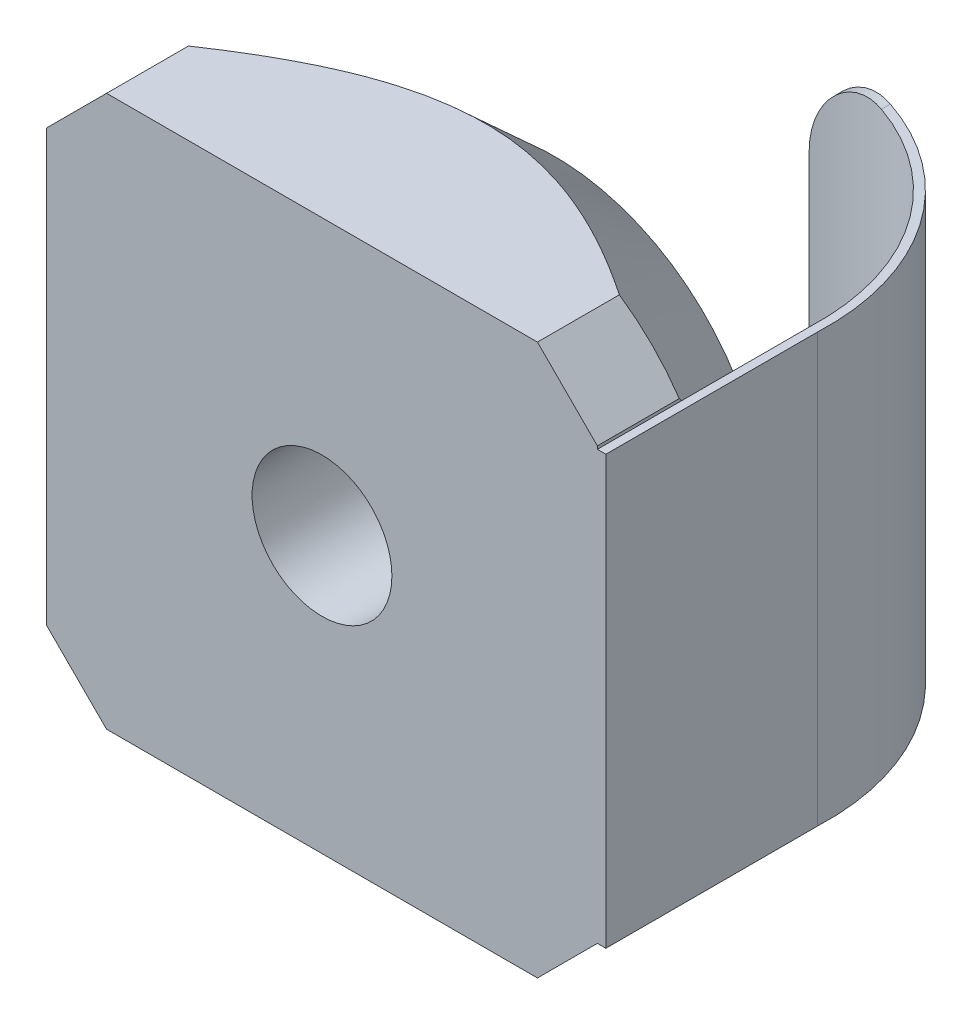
ISO-10303-21;
HEADER;
FILE_DESCRIPTION(('STEP AP214'),'2;1');
FILE_NAME('part.step','',(''),(''),'','','');
FILE_SCHEMA(('AUTOMOTIVE_DESIGN { 1 0 10303 214 1 1 1 1 }'));
ENDSEC;
DATA;
#1=APPLICATION_CONTEXT('core data for automotive mechanical design processes');
#2=APPLICATION_PROTOCOL_DEFINITION('international standard','automotive_design',2000,#1);
#3=PRODUCT_CONTEXT('',#1,'mechanical');
#4=PRODUCT('Part','Part','',(#3));
#5=PRODUCT_RELATED_PRODUCT_CATEGORY('part','',(#4));
#6=PRODUCT_DEFINITION_FORMATION('','',#4);
#7=PRODUCT_DEFINITION_CONTEXT('part definition',#1,'design');
#8=PRODUCT_DEFINITION('design','',#6,#7);
#9=PRODUCT_DEFINITION_SHAPE('','',#8);
#10=(LENGTH_UNIT() NAMED_UNIT(*) SI_UNIT(.MILLI.,.METRE.));
#11=(NAMED_UNIT(*) PLANE_ANGLE_UNIT() SI_UNIT($,.RADIAN.));
#12=(NAMED_UNIT(*) SI_UNIT($,.STERADIAN.) SOLID_ANGLE_UNIT());
#13=UNCERTAINTY_MEASURE_WITH_UNIT(LENGTH_MEASURE(1.E-05),#10,'distance_accuracy_value','');
#14=(GEOMETRIC_REPRESENTATION_CONTEXT(3) GLOBAL_UNCERTAINTY_ASSIGNED_CONTEXT((#13)) GLOBAL_UNIT_ASSIGNED_CONTEXT((#10,
#11,#12)) REPRESENTATION_CONTEXT('',''));
#15=CARTESIAN_POINT('',(0.,0.,0.));
#16=DIRECTION('',(0.,0.,1.));
#17=DIRECTION('',(1.,0.,0.));
#18=AXIS2_PLACEMENT_3D('',#15,#16,#17);
#19=CARTESIAN_POINT('',(0.,0.,-5.5));
#20=DIRECTION('',(0.,0.,1.));
#21=DIRECTION('',(1.,0.,0.));
#22=AXIS2_PLACEMENT_3D('',#19,#20,#21);
#23=PLANE('',#22);
#24=CARTESIAN_POINT('',(0.,0.,-5.5));
#25=DIRECTION('',(0.,0.,1.));
#26=DIRECTION('',(1.,0.,0.));
#27=AXIS2_PLACEMENT_3D('',#24,#25,#26);
#28=CIRCLE('',#27,1.65);
#29=CARTESIAN_POINT('',(1.65,0.,-5.5));
#30=VERTEX_POINT('',#29);
#31=EDGE_CURVE('E327',#30,#30,#28,.T.);
#32=ORIENTED_EDGE('',*,*,#31,.T.);
#33=EDGE_LOOP('',(#32));
#34=FACE_BOUND('',#33,.T.);
#35=CARTESIAN_POINT('',(0.,0.,-5.50000000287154));
#36=DIRECTION('',(0.,0.,1.));
#37=DIRECTION('',(1.,0.,0.));
#38=AXIS2_PLACEMENT_3D('',#35,#36,#37);
#39=CIRCLE('',#38,5.00000000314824);
#40=CARTESIAN_POINT('',(5.00000000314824,0.,-5.50000000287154));
#41=VERTEX_POINT('',#40);
#42=EDGE_CURVE('E288',#41,#41,#39,.T.);
#43=ORIENTED_EDGE('',*,*,#42,.F.);
#44=EDGE_LOOP('',(#43));
#45=FACE_BOUND('',#44,.T.);
#46=ADVANCED_FACE('F30',(#34,#45),#23,.F.);
#47=CARTESIAN_POINT('',(1.13061329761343,-5.08578643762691,-5.23061329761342));
#48=DIRECTION('',(0.,1.,0.));
#49=DIRECTION('',(0.,0.,1.));
#50=AXIS2_PLACEMENT_3D('',#47,#48,#49);
#51=CYLINDRICAL_SURFACE('',#50,5.37433680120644);
#52=DIRECTION('',(0.,1.,0.));
#53=VECTOR('',#52,1.);
#54=CARTESIAN_POINT('',(0.900000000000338,-5.08578643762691,-10.6));
#55=LINE('',#54,#53);
#56=CARTESIAN_POINT('',(0.900000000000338,-3.08578643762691,-10.6));
#57=VERTEX_POINT('',#56);
#58=CARTESIAN_POINT('',(0.900000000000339,3.01421356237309,-10.6));
#59=VERTEX_POINT('',#58);
#60=EDGE_CURVE('E130',#57,#59,#55,.T.);
#61=ORIENTED_EDGE('',*,*,#60,.F.);
#62=CARTESIAN_POINT('',(2.90000000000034,-5.08578643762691,-10.3053316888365));
#63=CARTESIAN_POINT('',(2.84803419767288,-5.08579244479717,-10.3234580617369));
#64=CARTESIAN_POINT('',(2.79577900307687,-5.08376089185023,-10.34077491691));
#65=CARTESIAN_POINT('',(2.69104946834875,-5.07553358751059,-10.3737183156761));
#66=CARTESIAN_POINT('',(2.63857507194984,-5.0693366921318,-10.3893443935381));
#67=CARTESIAN_POINT('',(2.53380993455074,-5.05269177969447,-10.4188209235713));
#68=CARTESIAN_POINT('',(2.48151914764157,-5.04224491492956,-10.4326718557));
#69=CARTESIAN_POINT('',(2.37754341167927,-5.01708267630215,-10.4585706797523));
#70=CARTESIAN_POINT('',(2.32585839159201,-5.00236780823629,-10.4706187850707));
#71=CARTESIAN_POINT('',(2.17211110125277,-4.95174451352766,-10.504107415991));
#72=CARTESIAN_POINT('',(2.07148948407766,-4.90937809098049,-10.5228554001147));
#73=CARTESIAN_POINT('',(1.8778476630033,-4.80832605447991,-10.5536557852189));
#74=CARTESIAN_POINT('',(1.78482256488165,-4.74965105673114,-10.5657125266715));
#75=CARTESIAN_POINT('',(1.61135189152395,-4.61905010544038,-10.5841005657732));
#76=CARTESIAN_POINT('',(1.53066546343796,-4.5474613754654,-10.5905576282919));
#77=CARTESIAN_POINT('',(1.3817294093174,-4.39209571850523,-10.5996001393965));
#78=CARTESIAN_POINT('',(1.31348514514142,-4.30831356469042,-10.602183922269));
#79=CARTESIAN_POINT('',(1.19010431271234,-4.12902241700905,-10.6049836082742));
#80=CARTESIAN_POINT('',(1.13526474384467,-4.03330843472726,-10.605149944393));
#81=CARTESIAN_POINT('',(1.04205250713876,-3.83419182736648,-10.6044227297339));
#82=CARTESIAN_POINT('',(1.00367583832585,-3.7307910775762,-10.6035294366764));
#83=CARTESIAN_POINT('',(0.949511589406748,-3.53731687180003,-10.6019565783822));
#84=CARTESIAN_POINT('',(0.930977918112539,-3.4480009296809,-10.6012666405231));
#85=CARTESIAN_POINT('',(0.906208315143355,-3.26772910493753,-10.6002660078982));
#86=CARTESIAN_POINT('',(0.899965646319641,-3.17677414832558,-10.5999551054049));
#87=CARTESIAN_POINT('',(0.900000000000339,-3.08578643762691,-10.6));
#88=B_SPLINE_CURVE_WITH_KNOTS('',3,(#62,#63,#64,#65,#66,#67,#68,#69,#70,#71,#72,#73,#74,#75,#76,
#77,#78,#79,#80,#81,#82,#83,#84,#85,#86,#87),.UNSPECIFIED.,.F.,.F.,(4,2,2,2,2,2,2,2,2,2,2,2,4),
(0.,0.165074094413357,0.330193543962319,0.495268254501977,0.660323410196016,0.990846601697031,
1.32115513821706,1.64383733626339,1.96665826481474,2.29608914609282,2.625439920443,
2.89827884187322,3.17096816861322),.UNSPECIFIED.);
#89=CARTESIAN_POINT('',(2.90000000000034,-5.08578643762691,-10.3053316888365));
#90=VERTEX_POINT('',#89);
#91=EDGE_CURVE('E136',#90,#57,#88,.T.);
#92=ORIENTED_EDGE('',*,*,#91,.F.);
#93=CARTESIAN_POINT('',(1.13061329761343,-5.08578643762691,-5.23061329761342));
#94=DIRECTION('',(0.,1.,0.));
#95=DIRECTION('',(0.,0.,1.));
#96=AXIS2_PLACEMENT_3D('',#93,#94,#95);
#97=CIRCLE('',#96,5.37433680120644);
#98=CARTESIAN_POINT('',(6.5,-5.08578643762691,-5.));
#99=VERTEX_POINT('',#98);
#100=EDGE_CURVE('E264',#90,#99,#97,.F.);
#101=ORIENTED_EDGE('',*,*,#100,.T.);
#102=DIRECTION('',(0.,1.,0.));
#103=VECTOR('',#102,1.);
#104=CARTESIAN_POINT('',(6.5,-5.08578643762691,-5.00000000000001));
#105=LINE('',#104,#103);
#106=CARTESIAN_POINT('',(6.5,5.01421356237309,-5.00000000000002));
#107=VERTEX_POINT('',#106);
#108=EDGE_CURVE('E137',#107,#99,#105,.F.);
#109=ORIENTED_EDGE('',*,*,#108,.F.);
#110=CARTESIAN_POINT('',(1.13061329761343,5.01421356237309,-5.23061329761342));
#111=DIRECTION('',(0.,1.,0.));
#112=DIRECTION('',(0.,0.,1.));
#113=AXIS2_PLACEMENT_3D('',#110,#111,#112);
#114=CIRCLE('',#113,5.37433680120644);
#115=CARTESIAN_POINT('',(2.90000000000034,5.01421356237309,-10.3053316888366));
#116=VERTEX_POINT('',#115);
#117=EDGE_CURVE('E133',#116,#107,#114,.F.);
#118=ORIENTED_EDGE('',*,*,#117,.F.);
#119=CARTESIAN_POINT('',(0.900000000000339,3.01421356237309,-10.6));
#120=CARTESIAN_POINT('',(0.900000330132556,3.07046535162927,-10.5999949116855));
#121=CARTESIAN_POINT('',(0.902374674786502,3.12669009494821,-10.6001025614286));
#122=CARTESIAN_POINT('',(0.911846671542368,3.23873632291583,-10.6004988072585));
#123=CARTESIAN_POINT('',(0.918944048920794,3.29455783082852,-10.6007873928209));
#124=CARTESIAN_POINT('',(0.947254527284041,3.46073025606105,-10.6018566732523));
#125=CARTESIAN_POINT('',(0.975486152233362,3.56996713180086,-10.6028411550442));
#126=CARTESIAN_POINT('',(1.04988306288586,3.78215272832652,-10.6044710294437));
#127=CARTESIAN_POINT('',(1.0960569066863,3.88509842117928,-10.6051162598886));
#128=CARTESIAN_POINT('',(1.20503246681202,4.08178799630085,-10.6047100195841));
#129=CARTESIAN_POINT('',(1.2678326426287,4.17553272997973,-10.6036587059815));
#130=CARTESIAN_POINT('',(1.40800107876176,4.35081056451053,-10.5982422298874));
#131=CARTESIAN_POINT('',(1.48532101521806,4.43238260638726,-10.593887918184));
#132=CARTESIAN_POINT('',(1.6522600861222,4.58126236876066,-10.58022750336));
#133=CARTESIAN_POINT('',(1.74187515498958,4.64857478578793,-10.5709230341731));
#134=CARTESIAN_POINT('',(1.92817494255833,4.76560487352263,-10.5462505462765));
#135=CARTESIAN_POINT('',(2.02464050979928,4.81570333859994,-10.5310321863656));
#136=CARTESIAN_POINT('',(2.22328367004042,4.89932935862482,-10.4936700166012));
#137=CARTESIAN_POINT('',(2.32546183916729,4.93285523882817,-10.4715255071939));
#138=CARTESIAN_POINT('',(2.50694959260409,4.97686434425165,-10.4263509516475));
#139=CARTESIAN_POINT('',(2.58579039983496,4.99096532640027,-10.4048403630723));
#140=CARTESIAN_POINT('',(2.74330698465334,5.00964641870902,-10.3579469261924));
#141=CARTESIAN_POINT('',(2.82198281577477,5.01424259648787,-10.3325706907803));
#142=CARTESIAN_POINT('',(2.90000000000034,5.01421356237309,-10.3053316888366));
#143=B_SPLINE_CURVE_WITH_KNOTS('',3,(#119,#120,#121,#122,#123,#124,#125,#126,#127,#128,#129,
#130,#131,#132,#133,#134,#135,#136,#137,#138,#139,#140,#141,#142),.UNSPECIFIED.,.F.,.F.,(4,2,2,
2,2,2,2,2,2,2,2,4),(0.,0.168651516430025,0.337293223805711,0.674049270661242,1.01096614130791,
1.3478518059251,1.68363552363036,2.01930847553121,2.34698849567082,2.67470162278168,
2.92287445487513,3.17062741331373),.UNSPECIFIED.);
#144=EDGE_CURVE('E33',#59,#116,#143,.T.);
#145=ORIENTED_EDGE('',*,*,#144,.F.);
#146=EDGE_LOOP('',(#61,#92,#101,#109,#118,#145));
#147=FACE_BOUND('',#146,.T.);
#148=ADVANCED_FACE('F128',(#147),#51,.F.);
#149=CARTESIAN_POINT('',(6.5,-5.08578643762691,0.));
#150=DIRECTION('',(-1.,0.,0.));
#151=DIRECTION('',(0.,0.,1.));
#152=AXIS2_PLACEMENT_3D('',#149,#150,#151);
#153=PLANE('',#152);
#154=ORIENTED_EDGE('',*,*,#108,.T.);
#155=DIRECTION('',(0.,0.,1.));
#156=VECTOR('',#155,1.);
#157=CARTESIAN_POINT('',(6.5,-5.08578643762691,-6.41150462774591));
#158=LINE('',#157,#156);
#159=CARTESIAN_POINT('',(6.5,-5.08578639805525,-1.93333422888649));
#160=VERTEX_POINT('',#159);
#161=EDGE_CURVE('E361',#99,#160,#158,.T.);
#162=ORIENTED_EDGE('',*,*,#161,.T.);
#163=CARTESIAN_POINT('',(6.49999999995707,5.01421356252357,-1.98147651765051));
#164=CARTESIAN_POINT('',(6.49999999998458,4.90089300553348,-2.05735219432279));
#165=CARTESIAN_POINT('',(6.49999999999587,4.78682941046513,-2.13213187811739));
#166=CARTESIAN_POINT('',(6.50000000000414,4.55705300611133,-2.27916665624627));
#167=CARTESIAN_POINT('',(6.50000000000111,4.44133984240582,-2.35142119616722));
#168=CARTESIAN_POINT('',(6.49999999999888,4.2077031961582,-2.49331131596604));
#169=CARTESIAN_POINT('',(6.49999999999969,4.08977293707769,-2.56293578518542));
#170=CARTESIAN_POINT('',(6.50000000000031,3.85200835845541,-2.69883005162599));
#171=CARTESIAN_POINT('',(6.50000000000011,3.73217414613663,-2.76510003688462));
#172=CARTESIAN_POINT('',(6.49999999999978,3.36347781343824,-2.96142749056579));
#173=CARTESIAN_POINT('',(6.49999999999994,3.11129685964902,-3.08537257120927));
#174=CARTESIAN_POINT('',(6.50000000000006,2.59770756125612,-3.31174910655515));
#175=CARTESIAN_POINT('',(6.50000000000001,2.33631394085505,-3.41421322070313));
#176=CARTESIAN_POINT('',(6.49999999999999,1.89822792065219,-3.55997176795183));
#177=CARTESIAN_POINT('',(6.5,1.72423965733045,-3.61138096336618));
#178=CARTESIAN_POINT('',(6.5,1.37277217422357,-3.70067669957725));
#179=CARTESIAN_POINT('',(6.5,1.19529289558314,-3.73856301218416));
#180=CARTESIAN_POINT('',(6.5,0.839667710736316,-3.79880141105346));
#181=CARTESIAN_POINT('',(6.5,0.661549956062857,-3.82131766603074));
#182=CARTESIAN_POINT('',(6.5,0.3040090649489,-3.8503496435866));
#183=CARTESIAN_POINT('',(6.5,0.124586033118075,-3.85686663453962));
#184=CARTESIAN_POINT('',(6.5,-0.234534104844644,-3.85354991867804));
#185=CARTESIAN_POINT('',(6.5,-0.414230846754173,-3.84367725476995));
#186=CARTESIAN_POINT('',(6.5,-0.772032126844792,-3.80803294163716));
#187=CARTESIAN_POINT('',(6.5,-0.950136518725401,-3.78225984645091));
#188=CARTESIAN_POINT('',(6.5,-1.30552029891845,-3.71570927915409));
#189=CARTESIAN_POINT('',(6.5,-1.48276890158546,-3.67476939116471));
#190=CARTESIAN_POINT('',(6.5,-1.83363232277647,-3.57968542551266));
#191=CARTESIAN_POINT('',(6.5,-2.00724719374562,-3.52554153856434));
#192=CARTESIAN_POINT('',(6.5,-2.44147704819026,-3.37423611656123));
#193=CARTESIAN_POINT('',(6.5,-2.69944314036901,-3.2694828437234));
#194=CARTESIAN_POINT('',(6.5,-3.20636233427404,-3.03963560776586));
#195=CARTESIAN_POINT('',(6.5,-3.45530232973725,-2.91451340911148));
#196=CARTESIAN_POINT('',(6.5,-3.9386424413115,-2.65236001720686));
#197=CARTESIAN_POINT('',(6.5,-4.17325100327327,-2.51570956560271));
#198=CARTESIAN_POINT('',(6.5,-4.51960285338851,-2.3026955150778));
#199=CARTESIAN_POINT('',(6.5,-4.63393607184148,-2.23048126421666));
#200=CARTESIAN_POINT('',(6.5,-4.86101206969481,-2.08364094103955));
#201=CARTESIAN_POINT('',(6.5,-4.97375516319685,-2.00901535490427));
#202=CARTESIAN_POINT('',(6.5,-5.08578635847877,-1.93333425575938));
#203=B_SPLINE_CURVE_WITH_KNOTS('',3,(#163,#164,#165,#166,#167,#168,#169,#170,#171,#172,#173,
#174,#175,#176,#177,#178,#179,#180,#181,#182,#183,#184,#185,#186,#187,#188,#189,#190,#191,#192,
#193,#194,#195,#196,#197,#198,#199,#200,#201,#202),.UNSPECIFIED.,.F.,.F.,(4,2,2,2,2,2,2,2,2,2,2,
2,2,2,2,2,2,2,2,4),(0.,0.409135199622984,0.8183596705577,1.2291540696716,1.63992541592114,
2.48215150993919,3.32308765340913,3.86690681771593,4.4107351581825,4.94865991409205,
5.48654202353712,6.02570447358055,6.56491596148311,7.11007693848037,7.6552300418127,
8.48926109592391,9.32445829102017,10.1385545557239,10.5442192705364,10.949802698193),.UNSPECIFIED.);
#204=CARTESIAN_POINT('',(6.5,5.01421356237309,-1.98147651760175));
#205=VERTEX_POINT('',#204);
#206=EDGE_CURVE('E191',#205,#160,#203,.T.);
#207=ORIENTED_EDGE('',*,*,#206,.F.);
#208=DIRECTION('',(0.,0.,1.));
#209=VECTOR('',#208,1.);
#210=CARTESIAN_POINT('',(6.5,5.01421356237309,-6.41150462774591));
#211=LINE('',#210,#209);
#212=EDGE_CURVE('E294',#107,#205,#211,.T.);
#213=ORIENTED_EDGE('',*,*,#212,.F.);
#214=EDGE_LOOP('',(#154,#162,#207,#213));
#215=FACE_BOUND('',#214,.T.);
#216=ADVANCED_FACE('F269',(#215),#153,.T.);
#217=CARTESIAN_POINT('',(2.90000000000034,3.01421356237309,-8.50575231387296));
#218=DIRECTION('',(0.,0.,-1.));
#219=DIRECTION('',(0.,1.,0.));
#220=AXIS2_PLACEMENT_3D('',#217,#218,#219);
#221=CYLINDRICAL_SURFACE('',#220,2.);
#222=ORIENTED_EDGE('',*,*,#144,.T.);
#223=DIRECTION('',(0.,0.,1.));
#224=VECTOR('',#223,1.);
#225=CARTESIAN_POINT('',(2.90000000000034,5.01421356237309,-6.41150462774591));
#226=LINE('',#225,#224);
#227=CARTESIAN_POINT('',(2.90000000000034,5.01421356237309,-10.5164927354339));
#228=VERTEX_POINT('',#227);
#229=EDGE_CURVE('E291',#228,#116,#226,.T.);
#230=ORIENTED_EDGE('',*,*,#229,.F.);
#231=CARTESIAN_POINT('',(0.900000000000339,3.01421356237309,-10.8));
#232=CARTESIAN_POINT('',(0.90000033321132,3.07046660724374,-10.7999950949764));
#233=CARTESIAN_POINT('',(0.902374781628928,3.12669261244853,-10.8000988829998));
#234=CARTESIAN_POINT('',(0.911847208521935,3.2387414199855,-10.8004809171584));
#235=CARTESIAN_POINT('',(0.918944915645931,3.29456424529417,-10.8007591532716));
#236=CARTESIAN_POINT('',(0.947256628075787,3.46073994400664,-10.8017900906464));
#237=CARTESIAN_POINT('',(0.975489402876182,3.56997882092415,-10.8027392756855));
#238=CARTESIAN_POINT('',(1.04988921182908,3.78216784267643,-10.8043106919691));
#239=CARTESIAN_POINT('',(1.09606480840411,3.88511495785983,-10.8049327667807));
#240=CARTESIAN_POINT('',(1.20504374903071,4.08180608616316,-10.8045408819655));
#241=CARTESIAN_POINT('',(1.2678454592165,4.17555100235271,-10.8035270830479));
#242=CARTESIAN_POINT('',(1.40803624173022,4.35085229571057,-10.7983038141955));
#243=CARTESIAN_POINT('',(1.48538034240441,4.43244489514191,-10.7941040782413));
#244=CARTESIAN_POINT('',(1.65239289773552,4.58137143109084,-10.7809278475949));
#245=CARTESIAN_POINT('',(1.74205772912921,4.64870954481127,-10.7719527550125));
#246=CARTESIAN_POINT('',(1.92866159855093,4.76589089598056,-10.748131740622));
#247=CARTESIAN_POINT('',(2.02539514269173,4.81608909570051,-10.7334204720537));
#248=CARTESIAN_POINT('',(2.22467295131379,4.89984546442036,-10.6972870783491));
#249=CARTESIAN_POINT('',(2.32721752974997,4.93340273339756,-10.6758645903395));
#250=CARTESIAN_POINT('',(2.50869878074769,4.97719479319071,-10.632328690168));
#251=CARTESIAN_POINT('',(2.58712849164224,4.99116285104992,-10.611726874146));
#252=CARTESIAN_POINT('',(2.74390539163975,5.00967798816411,-10.5668354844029));
#253=CARTESIAN_POINT('',(2.82225249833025,5.01424083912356,-10.5425521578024));
#254=CARTESIAN_POINT('',(2.90000000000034,5.01421356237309,-10.5164927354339));
#255=B_SPLINE_CURVE_WITH_KNOTS('',3,(#231,#232,#233,#234,#235,#236,#237,#238,#239,#240,#241,
#242,#243,#244,#245,#246,#247,#248,#249,#250,#251,#252,#253,#254),.UNSPECIFIED.,.F.,.F.,(4,2,2,
2,2,2,2,2,2,2,2,4),(0.,0.168655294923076,0.337300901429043,0.674062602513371,1.01098520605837,
1.34787471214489,1.68373904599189,2.01950481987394,2.34782208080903,2.67615709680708,
2.92240952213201,3.16824866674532),.UNSPECIFIED.);
#256=CARTESIAN_POINT('',(0.90000000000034,3.01421356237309,-10.8));
#257=VERTEX_POINT('',#256);
#258=EDGE_CURVE('E142',#257,#228,#255,.T.);
#259=ORIENTED_EDGE('',*,*,#258,.F.);
#260=DIRECTION('',(0.,0.,1.));
#261=VECTOR('',#260,1.);
#262=CARTESIAN_POINT('',(0.900000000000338,3.01421356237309,-10.6));
#263=LINE('',#262,#261);
#264=EDGE_CURVE('E139',#59,#257,#263,.F.);
#265=ORIENTED_EDGE('',*,*,#264,.F.);
#266=EDGE_LOOP('',(#222,#230,#259,#265));
#267=FACE_BOUND('',#266,.T.);
#268=ADVANCED_FACE('F140',(#267),#221,.T.);
#269=CARTESIAN_POINT('',(2.90000000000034,-3.08578643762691,-8.50575231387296));
#270=DIRECTION('',(0.,0.,-1.));
#271=DIRECTION('',(0.,1.,0.));
#272=AXIS2_PLACEMENT_3D('',#269,#270,#271);
#273=CYLINDRICAL_SURFACE('',#272,2.);
#274=ORIENTED_EDGE('',*,*,#91,.T.);
#275=DIRECTION('',(0.,0.,1.));
#276=VECTOR('',#275,1.);
#277=CARTESIAN_POINT('',(0.900000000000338,-3.08578643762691,-10.6));
#278=LINE('',#277,#276);
#279=CARTESIAN_POINT('',(0.900000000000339,-3.08578643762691,-10.8));
#280=VERTEX_POINT('',#279);
#281=EDGE_CURVE('E146',#280,#57,#278,.T.);
#282=ORIENTED_EDGE('',*,*,#281,.F.);
#283=CARTESIAN_POINT('',(2.90000000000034,-5.08578643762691,-10.5164927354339));
#284=CARTESIAN_POINT('',(2.84773330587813,-5.08579243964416,-10.5339958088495));
#285=CARTESIAN_POINT('',(2.7951967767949,-5.08373738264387,-10.5507123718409));
#286=CARTESIAN_POINT('',(2.68994638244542,-5.07542438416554,-10.5825039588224));
#287=CARTESIAN_POINT('',(2.63723247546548,-5.06916537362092,-10.5975785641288));
#288=CARTESIAN_POINT('',(2.53203314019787,-5.05236625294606,-10.6260042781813));
#289=CARTESIAN_POINT('',(2.47954764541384,-5.04182748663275,-10.6393559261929));
#290=CARTESIAN_POINT('',(2.37522367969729,-5.01645900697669,-10.6643117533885));
#291=CARTESIAN_POINT('',(2.3233851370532,-5.00162977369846,-10.6759161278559));
#292=CARTESIAN_POINT('',(2.16924708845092,-4.95064339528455,-10.7081555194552));
#293=CARTESIAN_POINT('',(2.06844710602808,-4.90800669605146,-10.7261843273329));
#294=CARTESIAN_POINT('',(1.87457099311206,-4.80639248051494,-10.7557763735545));
#295=CARTESIAN_POINT('',(1.78149015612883,-4.7474250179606,-10.7673435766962));
#296=CARTESIAN_POINT('',(1.60786619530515,-4.6161382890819,-10.7849753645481));
#297=CARTESIAN_POINT('',(1.52709626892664,-4.54413384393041,-10.791153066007));
#298=CARTESIAN_POINT('',(1.37811156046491,-4.38790607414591,-10.7997766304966));
#299=CARTESIAN_POINT('',(1.30990199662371,-4.30367769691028,-10.8022209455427));
#300=CARTESIAN_POINT('',(1.18678163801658,-4.12357808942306,-10.8048373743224));
#301=CARTESIAN_POINT('',(1.13215296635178,-4.02751350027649,-10.8049647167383));
#302=CARTESIAN_POINT('',(1.03944887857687,-3.82772407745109,-10.8042200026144));
#303=CARTESIAN_POINT('',(1.00136905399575,-3.72400129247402,-10.8033482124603));
#304=CARTESIAN_POINT('',(0.948189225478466,-3.53131953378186,-10.8018401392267));
#305=CARTESIAN_POINT('',(0.930148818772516,-3.4431591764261,-10.8011900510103));
#306=CARTESIAN_POINT('',(0.906041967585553,-3.26527166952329,-10.8002496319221));
#307=CARTESIAN_POINT('',(0.899968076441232,-3.1755455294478,-10.7999590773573));
#308=CARTESIAN_POINT('',(0.900000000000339,-3.08578643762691,-10.8));
#309=B_SPLINE_CURVE_WITH_KNOTS('',3,(#283,#284,#285,#286,#287,#288,#289,#290,#291,#292,#293,
#294,#295,#296,#297,#298,#299,#300,#301,#302,#303,#304,#305,#306,#307,#308),.UNSPECIFIED.,.F.,
.F.,(4,2,2,2,2,2,2,2,2,2,2,2,4),(0.,0.165322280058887,0.330686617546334,0.495999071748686,
0.661293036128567,0.992258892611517,1.32302144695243,1.64666220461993,1.97043711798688,
2.30046189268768,2.63039869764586,2.89957755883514,3.1685888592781),.UNSPECIFIED.);
#310=CARTESIAN_POINT('',(2.90000000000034,-5.08578643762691,-10.5164927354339));
#311=VERTEX_POINT('',#310);
#312=EDGE_CURVE('E237',#311,#280,#309,.T.);
#313=ORIENTED_EDGE('',*,*,#312,.F.);
#314=DIRECTION('',(0.,0.,1.));
#315=VECTOR('',#314,1.);
#316=CARTESIAN_POINT('',(2.90000000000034,-5.08578643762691,-6.41150462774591));
#317=LINE('',#316,#315);
#318=EDGE_CURVE('E263',#311,#90,#317,.T.);
#319=ORIENTED_EDGE('',*,*,#318,.T.);
#320=EDGE_LOOP('',(#274,#282,#313,#319));
#321=FACE_BOUND('',#320,.T.);
#322=ADVANCED_FACE('F268',(#321),#273,.T.);
#323=CARTESIAN_POINT('',(0.900000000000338,-5.08578643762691,-10.6));
#324=DIRECTION('',(-1.,0.,0.));
#325=DIRECTION('',(0.,0.,1.));
#326=AXIS2_PLACEMENT_3D('',#323,#324,#325);
#327=PLANE('',#326);
#328=ORIENTED_EDGE('',*,*,#281,.T.);
#329=ORIENTED_EDGE('',*,*,#60,.T.);
#330=ORIENTED_EDGE('',*,*,#264,.T.);
#331=DIRECTION('',(0.,1.,0.));
#332=VECTOR('',#331,1.);
#333=CARTESIAN_POINT('',(0.90000000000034,-5.08578643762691,-10.8));
#334=LINE('',#333,#332);
#335=EDGE_CURVE('E236',#280,#257,#334,.T.);
#336=ORIENTED_EDGE('',*,*,#335,.F.);
#337=EDGE_LOOP('',(#328,#329,#330,#336));
#338=FACE_BOUND('',#337,.T.);
#339=ADVANCED_FACE('F148',(#338),#327,.T.);
#340=CARTESIAN_POINT('',(6.5,-5.08578643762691,0.));
#341=DIRECTION('',(1.,0.,0.));
#342=DIRECTION('',(0.,0.,-1.));
#343=AXIS2_PLACEMENT_3D('',#340,#341,#342);
#344=PLANE('',#343);
#345=DIRECTION('',(0.,0.,1.));
#346=VECTOR('',#345,1.);
#347=CARTESIAN_POINT('',(6.5,5.08578643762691,0.));
#348=LINE('',#347,#346);
#349=CARTESIAN_POINT('',(6.5,5.08578643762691,0.));
#350=VERTEX_POINT('',#349);
#351=CARTESIAN_POINT('',(6.50000000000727,5.08578643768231,-1.93333420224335));
#352=VERTEX_POINT('',#351);
#353=EDGE_CURVE('E235',#350,#352,#348,.F.);
#354=ORIENTED_EDGE('',*,*,#353,.F.);
#355=DIRECTION('',(0.,1.,0.));
#356=VECTOR('',#355,1.);
#357=CARTESIAN_POINT('',(6.5,-5.08578643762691,0.));
#358=LINE('',#357,#356);
#359=CARTESIAN_POINT('',(6.5,5.01421356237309,0.));
#360=VERTEX_POINT('',#359);
#361=EDGE_CURVE('E149',#350,#360,#358,.F.);
#362=ORIENTED_EDGE('',*,*,#361,.T.);
#363=DIRECTION('',(0.,0.,1.));
#364=VECTOR('',#363,1.);
#365=CARTESIAN_POINT('',(6.5,5.01421356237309,-6.41150462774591));
#366=LINE('',#365,#364);
#367=EDGE_CURVE('E156',#205,#360,#366,.T.);
#368=ORIENTED_EDGE('',*,*,#367,.F.);
#369=CARTESIAN_POINT('',(6.49999999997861,5.08578643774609,-1.93333420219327));
#370=CARTESIAN_POINT('',(6.4999999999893,5.07387404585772,-1.94138233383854));
#371=CARTESIAN_POINT('',(6.49999999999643,5.0619534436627,-1.94941825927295));
#372=CARTESIAN_POINT('',(6.50000000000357,5.03809581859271,-1.96546569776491));
#373=CARTESIAN_POINT('',(6.50000000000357,5.02615879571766,-1.9734772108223));
#374=CARTESIAN_POINT('',(6.5,5.01421356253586,-1.98147651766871));
#375=B_SPLINE_CURVE_WITH_KNOTS('',3,(#369,#370,#371,#372,#373,#374),.UNSPECIFIED.,.F.,.F.,(4,2,
4),(0.,0.0431287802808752,0.0862575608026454),.UNSPECIFIED.);
#376=EDGE_CURVE('E151',#352,#205,#375,.T.);
#377=ORIENTED_EDGE('',*,*,#376,.F.);
#378=EDGE_LOOP('',(#354,#362,#368,#377));
#379=FACE_BOUND('',#378,.T.);
#380=ADVANCED_FACE('F183',(#379),#344,.T.);
#381=CARTESIAN_POINT('',(0.,0.,-1.91193420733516));
#382=DIRECTION('',(0.,0.,1.));
#383=DIRECTION('',(1.,0.,0.));
#384=AXIS2_PLACEMENT_3D('',#381,#382,#383);
#385=CONICAL_SURFACE('',#384,8.27271392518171,0.739466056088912);
#386=ORIENTED_EDGE('',*,*,#42,.T.);
#387=EDGE_LOOP('',(#386));
#388=FACE_BOUND('',#387,.T.);
#389=CARTESIAN_POINT('',(-6.49999999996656,5.08578643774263,-1.93333420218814));
#390=CARTESIAN_POINT('',(-6.49999999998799,4.97217656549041,-2.01007902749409));
#391=CARTESIAN_POINT('',(-6.49999999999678,4.85782950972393,-2.08574579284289));
#392=CARTESIAN_POINT('',(-6.50000000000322,4.62749756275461,-2.23459577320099));
#393=CARTESIAN_POINT('',(-6.50000000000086,4.51151233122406,-2.30777846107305));
#394=CARTESIAN_POINT('',(-6.49999999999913,4.27735001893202,-2.45156937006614));
#395=CARTESIAN_POINT('',(-6.49999999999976,4.15916634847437,-2.52216690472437));
#396=CARTESIAN_POINT('',(-6.50000000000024,3.92090179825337,-2.66006146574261));
#397=CARTESIAN_POINT('',(-6.50000000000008,3.80082102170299,-2.72735867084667));
#398=CARTESIAN_POINT('',(-6.49999999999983,3.43117049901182,-2.927024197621));
#399=CARTESIAN_POINT('',(-6.49999999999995,3.17828163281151,-3.05336340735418));
#400=CARTESIAN_POINT('',(-6.50000000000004,2.66320472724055,-3.2847897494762));
#401=CARTESIAN_POINT('',(-6.50000000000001,2.40103115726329,-3.38990837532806));
#402=CARTESIAN_POINT('',(-6.49999999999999,1.96194937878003,-3.54007016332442));
#403=CARTESIAN_POINT('',(-6.5,1.78780916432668,-3.5931930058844));
#404=CARTESIAN_POINT('',(-6.5,1.43593803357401,-3.68604206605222));
#405=CARTESIAN_POINT('',(-6.5,1.25820705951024,-3.72576806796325));
#406=CARTESIAN_POINT('',(-6.5,0.901971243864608,-3.78972854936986));
#407=CARTESIAN_POINT('',(-6.5,0.723496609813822,-3.81412921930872));
#408=CARTESIAN_POINT('',(-6.5,0.365074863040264,-3.84691624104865));
#409=CARTESIAN_POINT('',(-6.5,0.185127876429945,-3.85530395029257));
#410=CARTESIAN_POINT('',(-6.5,-0.175331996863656,-3.85561829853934));
#411=CARTESIAN_POINT('',(-6.5,-0.355844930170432,-3.84749448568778));
#412=CARTESIAN_POINT('',(-6.5,-0.715412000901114,-3.81512247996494));
#413=CARTESIAN_POINT('',(-6.5,-0.894466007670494,-3.79087285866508));
#414=CARTESIAN_POINT('',(-6.5,-1.25186987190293,-3.72710369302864));
#415=CARTESIAN_POINT('',(-6.5,-1.43018938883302,-3.6874161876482));
#416=CARTESIAN_POINT('',(-6.5,-1.7832209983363,-3.59454247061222));
#417=CARTESIAN_POINT('',(-6.5,-1.95793314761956,-3.54135647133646));
#418=CARTESIAN_POINT('',(-6.5,-2.39791270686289,-3.39110767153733));
#419=CARTESIAN_POINT('',(-6.5,-2.66041462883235,-3.2859613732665));
#420=CARTESIAN_POINT('',(-6.5,-3.17612601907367,-3.05441341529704));
#421=CARTESIAN_POINT('',(-6.5,-3.4293209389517,-2.92798006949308));
#422=CARTESIAN_POINT('',(-6.5,-3.79940591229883,-2.72814379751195));
#423=CARTESIAN_POINT('',(-6.5,-3.91962359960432,-2.66078705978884));
#424=CARTESIAN_POINT('',(-6.5,-4.15815744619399,-2.52276484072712));
#425=CARTESIAN_POINT('',(-6.5,-4.27647350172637,-2.45209917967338));
#426=CARTESIAN_POINT('',(-6.5,-4.510894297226,-2.30816632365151));
#427=CARTESIAN_POINT('',(-6.5,-4.62700566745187,-2.23490988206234));
#428=CARTESIAN_POINT('',(-6.5,-4.85758619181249,-2.08590677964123));
#429=CARTESIAN_POINT('',(-6.5,-4.97205568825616,-2.01016064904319));
#430=CARTESIAN_POINT('',(-6.5,-5.08578643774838,-1.93333420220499));
#431=B_SPLINE_CURVE_WITH_KNOTS('',3,(#389,#390,#391,#392,#393,#394,#395,#396,#397,#398,#399,
#400,#401,#402,#403,#404,#405,#406,#407,#408,#409,#410,#411,#412,#413,#414,#415,#416,#417,#418,
#419,#420,#421,#422,#423,#424,#425,#426,#427,#428,#429,#430),.UNSPECIFIED.,.F.,.F.,(4,2,2,2,2,2,
2,2,2,2,2,2,2,2,2,2,2,2,2,2,4),(0.,0.41131042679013,0.822707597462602,1.23564791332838,
1.64856583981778,2.49590493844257,3.34197710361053,3.88772071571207,4.43347311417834,
4.97320018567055,5.51288150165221,6.05421432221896,6.59559510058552,7.1430386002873,
7.69047348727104,8.53748456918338,9.38576777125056,9.79913116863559,10.2125170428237,
10.6243522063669,11.0361002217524),.UNSPECIFIED.);
#432=CARTESIAN_POINT('',(-6.50000000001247,5.08578643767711,-1.93333420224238));
#433=VERTEX_POINT('',#432);
#434=CARTESIAN_POINT('',(-6.50000000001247,-5.08578643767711,-1.93333420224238));
#435=VERTEX_POINT('',#434);
#436=EDGE_CURVE('E209',#433,#435,#431,.T.);
#437=ORIENTED_EDGE('',*,*,#436,.F.);
#438=CARTESIAN_POINT('',(-5.08578643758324,6.50000000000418,-1.93333420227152));
#439=CARTESIAN_POINT('',(-5.20320338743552,6.38258305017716,-1.95544496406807));
#440=CARTESIAN_POINT('',(-5.32114245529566,6.26464398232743,-1.97213629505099));
#441=CARTESIAN_POINT('',(-5.55702028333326,6.02876615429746,-1.99438943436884));
#442=CARTESIAN_POINT('',(-5.6749567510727,5.9108296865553,-2.00000000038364));
#443=CARTESIAN_POINT('',(-5.91082968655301,5.67495675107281,-2.00000000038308));
#444=CARTESIAN_POINT('',(-6.02876615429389,5.55702028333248,-1.99438943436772));
#445=CARTESIAN_POINT('',(-6.2646439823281,5.32114245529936,-1.97213629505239));
#446=CARTESIAN_POINT('',(-6.38258305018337,5.20320338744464,-1.95544496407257));
#447=CARTESIAN_POINT('',(-6.50000000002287,5.08578643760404,-1.93333420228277));
#448=B_SPLINE_CURVE_WITH_KNOTS('',3,(#438,#439,#440,#441,#442,#443,#444,#445,#446,#447),
.UNSPECIFIED.,.F.,.F.,(4,2,2,2,4),(0.,0.502492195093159,1.00276834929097,1.50304450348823,
2.00553669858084),.UNSPECIFIED.);
#449=CARTESIAN_POINT('',(-5.08578643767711,6.50000000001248,-1.93333420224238));
#450=VERTEX_POINT('',#449);
#451=EDGE_CURVE('E216',#450,#433,#448,.T.);
#452=ORIENTED_EDGE('',*,*,#451,.F.);
#453=CARTESIAN_POINT('',(5.08578643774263,6.49999999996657,-1.93333420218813));
#454=CARTESIAN_POINT('',(4.9721765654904,6.49999999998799,-2.01007902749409));
#455=CARTESIAN_POINT('',(4.85782950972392,6.49999999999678,-2.08574579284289));
#456=CARTESIAN_POINT('',(4.62749756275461,6.50000000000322,-2.23459577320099));
#457=CARTESIAN_POINT('',(4.51151233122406,6.50000000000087,-2.30777846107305));
#458=CARTESIAN_POINT('',(4.27735001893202,6.49999999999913,-2.45156937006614));
#459=CARTESIAN_POINT('',(4.15916634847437,6.49999999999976,-2.52216690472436));
#460=CARTESIAN_POINT('',(3.92090179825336,6.50000000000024,-2.66006146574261));
#461=CARTESIAN_POINT('',(3.80082102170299,6.50000000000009,-2.72735867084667));
#462=CARTESIAN_POINT('',(3.43117049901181,6.49999999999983,-2.927024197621));
#463=CARTESIAN_POINT('',(3.17828163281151,6.49999999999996,-3.05336340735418));
#464=CARTESIAN_POINT('',(2.66320472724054,6.50000000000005,-3.2847897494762));
#465=CARTESIAN_POINT('',(2.40103115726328,6.50000000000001,-3.38990837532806));
#466=CARTESIAN_POINT('',(1.96194937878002,6.5,-3.54007016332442));
#467=CARTESIAN_POINT('',(1.78780916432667,6.5,-3.5931930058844));
#468=CARTESIAN_POINT('',(1.435938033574,6.50000000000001,-3.68604206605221));
#469=CARTESIAN_POINT('',(1.25820705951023,6.5,-3.72576806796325));
#470=CARTESIAN_POINT('',(0.901971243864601,6.5,-3.78972854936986));
#471=CARTESIAN_POINT('',(0.723496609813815,6.5,-3.81412921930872));
#472=CARTESIAN_POINT('',(0.365074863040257,6.5,-3.84691624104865));
#473=CARTESIAN_POINT('',(0.185127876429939,6.5,-3.85530395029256));
#474=CARTESIAN_POINT('',(-0.175331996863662,6.5,-3.85561829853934));
#475=CARTESIAN_POINT('',(-0.355844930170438,6.5,-3.84749448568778));
#476=CARTESIAN_POINT('',(-0.715412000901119,6.5,-3.81512247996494));
#477=CARTESIAN_POINT('',(-0.8944660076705,6.5,-3.79087285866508));
#478=CARTESIAN_POINT('',(-1.25186987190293,6.5,-3.72710369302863));
#479=CARTESIAN_POINT('',(-1.43018938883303,6.5,-3.68741618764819));
#480=CARTESIAN_POINT('',(-1.7832209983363,6.5,-3.59454247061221));
#481=CARTESIAN_POINT('',(-1.95793314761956,6.5,-3.54135647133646));
#482=CARTESIAN_POINT('',(-2.3979127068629,6.5,-3.39110767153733));
#483=CARTESIAN_POINT('',(-2.66041462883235,6.5,-3.2859613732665));
#484=CARTESIAN_POINT('',(-3.17612601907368,6.5,-3.05441341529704));
#485=CARTESIAN_POINT('',(-3.4293209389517,6.5,-2.92798006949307));
#486=CARTESIAN_POINT('',(-3.79940591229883,6.5,-2.72814379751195));
#487=CARTESIAN_POINT('',(-3.91962359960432,6.5,-2.66078705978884));
#488=CARTESIAN_POINT('',(-4.15815744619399,6.5,-2.52276484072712));
#489=CARTESIAN_POINT('',(-4.27647350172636,6.5,-2.45209917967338));
#490=CARTESIAN_POINT('',(-4.510894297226,6.5,-2.30816632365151));
#491=CARTESIAN_POINT('',(-4.62700566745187,6.5,-2.23490988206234));
#492=CARTESIAN_POINT('',(-4.85758619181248,6.5,-2.08590677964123));
#493=CARTESIAN_POINT('',(-4.97205568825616,6.5,-2.01016064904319));
#494=CARTESIAN_POINT('',(-5.08578643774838,6.5,-1.93333420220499));
#495=B_SPLINE_CURVE_WITH_KNOTS('',3,(#453,#454,#455,#456,#457,#458,#459,#460,#461,#462,#463,
#464,#465,#466,#467,#468,#469,#470,#471,#472,#473,#474,#475,#476,#477,#478,#479,#480,#481,#482,
#483,#484,#485,#486,#487,#488,#489,#490,#491,#492,#493,#494),.UNSPECIFIED.,.F.,.F.,(4,2,2,2,2,2,
2,2,2,2,2,2,2,2,2,2,2,2,2,2,4),(0.,0.411310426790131,0.822707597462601,1.23564791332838,
1.64856583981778,2.49590493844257,3.34197710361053,3.88772071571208,4.43347311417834,
4.97320018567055,5.51288150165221,6.05421432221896,6.59559510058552,7.1430386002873,
7.69047348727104,8.53748456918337,9.38576777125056,9.79913116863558,10.2125170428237,
10.6243522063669,11.0361002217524),.UNSPECIFIED.);
#496=CARTESIAN_POINT('',(5.08578643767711,6.50000000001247,-1.93333420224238));
#497=VERTEX_POINT('',#496);
#498=EDGE_CURVE('E222',#497,#450,#495,.T.);
#499=ORIENTED_EDGE('',*,*,#498,.F.);
#500=CARTESIAN_POINT('',(6.50000000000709,5.08578643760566,-1.93333420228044));
#501=CARTESIAN_POINT('',(6.38258305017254,5.20320338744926,-1.95544496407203));
#502=CARTESIAN_POINT('',(6.26464398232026,5.32114245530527,-1.97213629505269));
#503=CARTESIAN_POINT('',(6.02876615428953,5.55702028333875,-1.99438943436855));
#504=CARTESIAN_POINT('',(5.91082968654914,5.67495675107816,-2.0000000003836));
#505=CARTESIAN_POINT('',(5.67495675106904,5.91082968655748,-2.00000000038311));
#506=CARTESIAN_POINT('',(5.55702028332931,6.0287661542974,-1.99438943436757));
#507=CARTESIAN_POINT('',(5.32114245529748,6.26464398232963,-1.97213629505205));
#508=CARTESIAN_POINT('',(5.20320338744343,6.38258305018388,-1.95544496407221));
#509=CARTESIAN_POINT('',(5.08578643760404,6.50000000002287,-1.93333420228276));
#510=B_SPLINE_CURVE_WITH_KNOTS('',3,(#500,#501,#502,#503,#504,#505,#506,#507,#508,#509),
.UNSPECIFIED.,.F.,.F.,(4,2,2,2,4),(0.,0.502492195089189,1.00276834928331,1.50304450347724,
2.00553669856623),.UNSPECIFIED.);
#511=EDGE_CURVE('E228',#352,#497,#510,.T.);
#512=ORIENTED_EDGE('',*,*,#511,.F.);
#513=ORIENTED_EDGE('',*,*,#376,.T.);
#514=ORIENTED_EDGE('',*,*,#206,.T.);
#515=CARTESIAN_POINT('',(5.08578643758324,-6.50000000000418,-1.93333420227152));
#516=CARTESIAN_POINT('',(5.2032033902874,-6.38258304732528,-1.95544496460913));
#517=CARTESIAN_POINT('',(5.32114246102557,-6.26464397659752,-1.97213629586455));
#518=CARTESIAN_POINT('',(5.55702029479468,-6.02876614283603,-1.99438943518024));
#519=CARTESIAN_POINT('',(5.67495676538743,-5.91082967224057,-2.00000000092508));
#520=CARTESIAN_POINT('',(5.91082970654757,-5.67495673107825,-1.99999999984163));
#521=CARTESIAN_POINT('',(6.02876617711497,-5.5570202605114,-1.99438943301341));
#522=CARTESIAN_POINT('',(6.26464401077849,-5.32114242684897,-1.97213629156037));
#523=CARTESIAN_POINT('',(6.38258308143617,-5.20320335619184,-1.95544495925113));
#524=CARTESIAN_POINT('',(6.50000003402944,-5.08578640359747,-1.93333419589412));
#525=B_SPLINE_CURVE_WITH_KNOTS('',3,(#515,#516,#517,#518,#519,#520,#521,#522,#523,#524),
.UNSPECIFIED.,.F.,.F.,(4,2,2,2,4),(0.,0.502492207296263,1.0027683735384,1.50304453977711,
2.00553674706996),.UNSPECIFIED.);
#526=CARTESIAN_POINT('',(5.08578643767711,-6.50000000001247,-1.93333420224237));
#527=VERTEX_POINT('',#526);
#528=EDGE_CURVE('E158',#527,#160,#525,.T.);
#529=ORIENTED_EDGE('',*,*,#528,.F.);
#530=CARTESIAN_POINT('',(-5.08578643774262,-6.49999999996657,-1.93333420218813));
#531=CARTESIAN_POINT('',(-4.9721765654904,-6.49999999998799,-2.01007902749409));
#532=CARTESIAN_POINT('',(-4.85782950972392,-6.49999999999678,-2.08574579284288));
#533=CARTESIAN_POINT('',(-4.62749756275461,-6.50000000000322,-2.23459577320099));
#534=CARTESIAN_POINT('',(-4.51151233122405,-6.50000000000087,-2.30777846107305));
#535=CARTESIAN_POINT('',(-4.27735001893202,-6.49999999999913,-2.45156937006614));
#536=CARTESIAN_POINT('',(-4.15916634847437,-6.49999999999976,-2.52216690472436));
#537=CARTESIAN_POINT('',(-3.92090179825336,-6.50000000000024,-2.6600614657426));
#538=CARTESIAN_POINT('',(-3.80082102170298,-6.50000000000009,-2.72735867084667));
#539=CARTESIAN_POINT('',(-3.43117049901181,-6.49999999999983,-2.927024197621));
#540=CARTESIAN_POINT('',(-3.1782816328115,-6.49999999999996,-3.05336340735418));
#541=CARTESIAN_POINT('',(-2.66320472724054,-6.50000000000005,-3.2847897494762));
#542=CARTESIAN_POINT('',(-2.40103115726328,-6.50000000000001,-3.38990837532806));
#543=CARTESIAN_POINT('',(-1.96194937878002,-6.5,-3.54007016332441));
#544=CARTESIAN_POINT('',(-1.78780916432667,-6.5,-3.5931930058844));
#545=CARTESIAN_POINT('',(-1.435938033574,-6.5,-3.68604206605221));
#546=CARTESIAN_POINT('',(-1.25820705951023,-6.5,-3.72576806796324));
#547=CARTESIAN_POINT('',(-0.9019712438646,-6.5,-3.78972854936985));
#548=CARTESIAN_POINT('',(-0.723496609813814,-6.5,-3.81412921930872));
#549=CARTESIAN_POINT('',(-0.365074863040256,-6.5,-3.84691624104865));
#550=CARTESIAN_POINT('',(-0.185127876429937,-6.5,-3.85530395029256));
#551=CARTESIAN_POINT('',(0.175331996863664,-6.5,-3.85561829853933));
#552=CARTESIAN_POINT('',(0.35584493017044,-6.5,-3.84749448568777));
#553=CARTESIAN_POINT('',(0.715412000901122,-6.5,-3.81512247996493));
#554=CARTESIAN_POINT('',(0.894466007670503,-6.5,-3.79087285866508));
#555=CARTESIAN_POINT('',(1.25186987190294,-6.5,-3.72710369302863));
#556=CARTESIAN_POINT('',(1.43018938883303,-6.5,-3.68741618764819));
#557=CARTESIAN_POINT('',(1.7832209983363,-6.5,-3.59454247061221));
#558=CARTESIAN_POINT('',(1.95793314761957,-6.5,-3.54135647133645));
#559=CARTESIAN_POINT('',(2.3979127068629,-6.5,-3.39110767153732));
#560=CARTESIAN_POINT('',(2.66041462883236,-6.5,-3.28596137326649));
#561=CARTESIAN_POINT('',(3.17612601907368,-6.5,-3.05441341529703));
#562=CARTESIAN_POINT('',(3.42932093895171,-6.5,-2.92798006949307));
#563=CARTESIAN_POINT('',(3.79940591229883,-6.5,-2.72814379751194));
#564=CARTESIAN_POINT('',(3.91962359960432,-6.5,-2.66078705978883));
#565=CARTESIAN_POINT('',(4.15815744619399,-6.5,-2.52276484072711));
#566=CARTESIAN_POINT('',(4.27647350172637,-6.5,-2.45209917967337));
#567=CARTESIAN_POINT('',(4.510894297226,-6.5,-2.30816632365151));
#568=CARTESIAN_POINT('',(4.62700566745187,-6.5,-2.23490988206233));
#569=CARTESIAN_POINT('',(4.85758619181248,-6.5,-2.08590677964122));
#570=CARTESIAN_POINT('',(4.97205568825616,-6.5,-2.01016064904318));
#571=CARTESIAN_POINT('',(5.08578643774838,-6.5,-1.93333420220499));
#572=B_SPLINE_CURVE_WITH_KNOTS('',3,(#530,#531,#532,#533,#534,#535,#536,#537,#538,#539,#540,
#541,#542,#543,#544,#545,#546,#547,#548,#549,#550,#551,#552,#553,#554,#555,#556,#557,#558,#559,
#560,#561,#562,#563,#564,#565,#566,#567,#568,#569,#570,#571),.UNSPECIFIED.,.F.,.F.,(4,2,2,2,2,2,
2,2,2,2,2,2,2,2,2,2,2,2,2,2,4),(0.,0.411310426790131,0.822707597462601,1.23564791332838,
1.64856583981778,2.49590493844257,3.34197710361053,3.88772071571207,4.43347311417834,
4.97320018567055,5.51288150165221,6.05421432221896,6.59559510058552,7.1430386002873,
7.69047348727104,8.53748456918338,9.38576777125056,9.79913116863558,10.2125170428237,
10.6243522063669,11.0361002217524),.UNSPECIFIED.);
#573=CARTESIAN_POINT('',(-5.08578643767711,-6.50000000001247,-1.93333420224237));
#574=VERTEX_POINT('',#573);
#575=EDGE_CURVE('E168',#574,#527,#572,.T.);
#576=ORIENTED_EDGE('',*,*,#575,.F.);
#577=CARTESIAN_POINT('',(-6.50000000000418,-5.08578643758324,-1.93333420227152));
#578=CARTESIAN_POINT('',(-6.38258305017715,-5.20320338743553,-1.95544496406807));
#579=CARTESIAN_POINT('',(-6.26464398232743,-5.32114245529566,-1.97213629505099));
#580=CARTESIAN_POINT('',(-6.02876615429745,-5.55702028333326,-1.99438943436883));
#581=CARTESIAN_POINT('',(-5.9108296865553,-5.6749567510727,-2.00000000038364));
#582=CARTESIAN_POINT('',(-5.6749567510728,-5.91082968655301,-2.00000000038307));
#583=CARTESIAN_POINT('',(-5.55702028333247,-6.02876615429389,-1.99438943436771));
#584=CARTESIAN_POINT('',(-5.32114245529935,-6.2646439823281,-1.97213629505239));
#585=CARTESIAN_POINT('',(-5.20320338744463,-6.38258305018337,-1.95544496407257));
#586=CARTESIAN_POINT('',(-5.08578643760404,-6.50000000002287,-1.93333420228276));
#587=B_SPLINE_CURVE_WITH_KNOTS('',3,(#577,#578,#579,#580,#581,#582,#583,#584,#585,#586),
.UNSPECIFIED.,.F.,.F.,(4,2,2,2,4),(0.,0.50249219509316,1.00276834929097,1.50304450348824,
2.00553669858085),.UNSPECIFIED.);
#588=EDGE_CURVE('E202',#435,#574,#587,.T.);
#589=ORIENTED_EDGE('',*,*,#588,.F.);
#590=EDGE_LOOP('',(#437,#452,#499,#512,#513,#514,#529,#576,#589));
#591=FACE_BOUND('',#590,.T.);
#592=ADVANCED_FACE('F177',(#388,#591),#385,.T.);
#593=CARTESIAN_POINT('',(5.22168348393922,5.01421356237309,-6.41150462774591));
#594=DIRECTION('',(0.,1.,0.));
#595=DIRECTION('',(0.,0.,1.));
#596=AXIS2_PLACEMENT_3D('',#593,#594,#595);
#597=PLANE('',#596);
#598=DIRECTION('',(0.,0.,-1.));
#599=VECTOR('',#598,1.);
#600=CARTESIAN_POINT('',(6.7,5.01421356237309,-5.));
#601=LINE('',#600,#599);
#602=CARTESIAN_POINT('',(6.7,5.01421356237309,-4.99999999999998));
#603=VERTEX_POINT('',#602);
#604=CARTESIAN_POINT('',(6.7,5.01421356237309,0.));
#605=VERTEX_POINT('',#604);
#606=EDGE_CURVE('E301',#603,#605,#601,.F.);
#607=ORIENTED_EDGE('',*,*,#606,.F.);
#608=CARTESIAN_POINT('',(1.13061329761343,5.01421356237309,-5.23061329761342));
#609=DIRECTION('',(0.,1.,0.));
#610=DIRECTION('',(0.,0.,1.));
#611=AXIS2_PLACEMENT_3D('',#608,#609,#610);
#612=CIRCLE('',#611,5.57415919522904);
#613=EDGE_CURVE('E262',#228,#603,#612,.F.);
#614=ORIENTED_EDGE('',*,*,#613,.F.);
#615=ORIENTED_EDGE('',*,*,#229,.T.);
#616=ORIENTED_EDGE('',*,*,#117,.T.);
#617=ORIENTED_EDGE('',*,*,#212,.T.);
#618=ORIENTED_EDGE('',*,*,#367,.T.);
#619=DIRECTION('',(1.,0.,0.));
#620=VECTOR('',#619,1.);
#621=CARTESIAN_POINT('',(5.22168348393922,5.01421356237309,0.));
#622=LINE('',#621,#620);
#623=EDGE_CURVE('E52',#360,#605,#622,.T.);
#624=ORIENTED_EDGE('',*,*,#623,.T.);
#625=EDGE_LOOP('',(#607,#614,#615,#616,#617,#618,#624));
#626=FACE_BOUND('',#625,.T.);
#627=ADVANCED_FACE('F182',(#626),#597,.T.);
#628=CARTESIAN_POINT('',(5.22168348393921,-5.08578643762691,-6.41150462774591));
#629=DIRECTION('',(0.,1.,0.));
#630=DIRECTION('',(0.,0.,1.));
#631=AXIS2_PLACEMENT_3D('',#628,#629,#630);
#632=PLANE('',#631);
#633=CARTESIAN_POINT('',(1.13061329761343,-5.08578643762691,-5.23061329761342));
#634=DIRECTION('',(0.,1.,0.));
#635=DIRECTION('',(0.,0.,1.));
#636=AXIS2_PLACEMENT_3D('',#633,#634,#635);
#637=CIRCLE('',#636,5.57415919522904);
#638=CARTESIAN_POINT('',(6.7,-5.08578643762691,-4.99999999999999));
#639=VERTEX_POINT('',#638);
#640=EDGE_CURVE('E374',#639,#311,#637,.T.);
#641=ORIENTED_EDGE('',*,*,#640,.F.);
#642=DIRECTION('',(0.,0.,-1.));
#643=VECTOR('',#642,1.);
#644=CARTESIAN_POINT('',(6.7,-5.08578643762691,-5.));
#645=LINE('',#644,#643);
#646=CARTESIAN_POINT('',(6.7,-5.08578643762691,0.));
#647=VERTEX_POINT('',#646);
#648=EDGE_CURVE('E303',#647,#639,#645,.T.);
#649=ORIENTED_EDGE('',*,*,#648,.F.);
#650=DIRECTION('',(1.,0.,0.));
#651=VECTOR('',#650,1.);
#652=CARTESIAN_POINT('',(5.22168348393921,-5.08578643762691,0.));
#653=LINE('',#652,#651);
#654=CARTESIAN_POINT('',(6.5,-5.08578643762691,0.));
#655=VERTEX_POINT('',#654);
#656=EDGE_CURVE('E360',#655,#647,#653,.T.);
#657=ORIENTED_EDGE('',*,*,#656,.F.);
#658=DIRECTION('',(0.,0.,1.));
#659=VECTOR('',#658,1.);
#660=CARTESIAN_POINT('',(6.5,-5.08578643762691,0.));
#661=LINE('',#660,#659);
#662=EDGE_CURVE('E166',#160,#655,#661,.T.);
#663=ORIENTED_EDGE('',*,*,#662,.F.);
#664=ORIENTED_EDGE('',*,*,#161,.F.);
#665=ORIENTED_EDGE('',*,*,#100,.F.);
#666=ORIENTED_EDGE('',*,*,#318,.F.);
#667=EDGE_LOOP('',(#641,#649,#657,#663,#664,#665,#666));
#668=FACE_BOUND('',#667,.T.);
#669=ADVANCED_FACE('F253',(#668),#632,.F.);
#670=CARTESIAN_POINT('',(1.13061329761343,-5.08578643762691,-5.23061329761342));
#671=DIRECTION('',(0.,1.,0.));
#672=DIRECTION('',(0.,0.,1.));
#673=AXIS2_PLACEMENT_3D('',#670,#671,#672);
#674=CYLINDRICAL_SURFACE('',#673,5.57415919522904);
#675=ORIENTED_EDGE('',*,*,#312,.T.);
#676=ORIENTED_EDGE('',*,*,#335,.T.);
#677=ORIENTED_EDGE('',*,*,#258,.T.);
#678=ORIENTED_EDGE('',*,*,#613,.T.);
#679=DIRECTION('',(0.,1.,0.));
#680=VECTOR('',#679,1.);
#681=CARTESIAN_POINT('',(6.7,-5.08578643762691,-5.));
#682=LINE('',#681,#680);
#683=EDGE_CURVE('E325',#639,#603,#682,.T.);
#684=ORIENTED_EDGE('',*,*,#683,.F.);
#685=ORIENTED_EDGE('',*,*,#640,.T.);
#686=EDGE_LOOP('',(#675,#676,#677,#678,#684,#685));
#687=FACE_BOUND('',#686,.T.);
#688=ADVANCED_FACE('F248',(#687),#674,.T.);
#689=CARTESIAN_POINT('',(6.5,5.08578643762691,0.));
#690=DIRECTION('',(0.707106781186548,0.707106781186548,0.));
#691=DIRECTION('',(-0.707106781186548,0.707106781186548,0.));
#692=AXIS2_PLACEMENT_3D('',#689,#690,#691);
#693=PLANE('',#692);
#694=DIRECTION('',(-0.707106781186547,0.707106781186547,0.));
#695=VECTOR('',#694,1.);
#696=CARTESIAN_POINT('',(6.5,5.08578643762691,0.));
#697=LINE('',#696,#695);
#698=CARTESIAN_POINT('',(5.08578643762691,6.5,0.));
#699=VERTEX_POINT('',#698);
#700=EDGE_CURVE('E323',#350,#699,#697,.T.);
#701=ORIENTED_EDGE('',*,*,#700,.F.);
#702=ORIENTED_EDGE('',*,*,#353,.T.);
#703=ORIENTED_EDGE('',*,*,#511,.T.);
#704=DIRECTION('',(0.,0.,1.));
#705=VECTOR('',#704,1.);
#706=CARTESIAN_POINT('',(5.08578643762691,6.5,0.));
#707=LINE('',#706,#705);
#708=EDGE_CURVE('E352',#699,#497,#707,.F.);
#709=ORIENTED_EDGE('',*,*,#708,.F.);
#710=EDGE_LOOP('',(#701,#702,#703,#709));
#711=FACE_BOUND('',#710,.T.);
#712=ADVANCED_FACE('F244',(#711),#693,.T.);
#713=CARTESIAN_POINT('',(5.08578643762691,6.5,0.));
#714=DIRECTION('',(0.,1.,0.));
#715=DIRECTION('',(0.,0.,1.));
#716=AXIS2_PLACEMENT_3D('',#713,#714,#715);
#717=PLANE('',#716);
#718=DIRECTION('',(1.,0.,0.));
#719=VECTOR('',#718,1.);
#720=CARTESIAN_POINT('',(0.,6.5,0.));
#721=LINE('',#720,#719);
#722=CARTESIAN_POINT('',(-5.0857864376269,6.50000000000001,0.));
#723=VERTEX_POINT('',#722);
#724=EDGE_CURVE('E320',#699,#723,#721,.F.);
#725=ORIENTED_EDGE('',*,*,#724,.F.);
#726=ORIENTED_EDGE('',*,*,#708,.T.);
#727=ORIENTED_EDGE('',*,*,#498,.T.);
#728=DIRECTION('',(0.,0.,1.));
#729=VECTOR('',#728,1.);
#730=CARTESIAN_POINT('',(-5.0857864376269,6.50000000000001,0.));
#731=LINE('',#730,#729);
#732=EDGE_CURVE('E349',#723,#450,#731,.F.);
#733=ORIENTED_EDGE('',*,*,#732,.F.);
#734=EDGE_LOOP('',(#725,#726,#727,#733));
#735=FACE_BOUND('',#734,.T.);
#736=ADVANCED_FACE('F247',(#735),#717,.T.);
#737=CARTESIAN_POINT('',(-5.0857864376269,6.50000000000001,0.));
#738=DIRECTION('',(-0.707106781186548,0.707106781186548,0.));
#739=DIRECTION('',(-0.707106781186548,-0.707106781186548,0.));
#740=AXIS2_PLACEMENT_3D('',#737,#738,#739);
#741=PLANE('',#740);
#742=DIRECTION('',(-0.707106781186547,-0.707106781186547,0.));
#743=VECTOR('',#742,1.);
#744=CARTESIAN_POINT('',(-5.0857864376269,6.50000000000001,0.));
#745=LINE('',#744,#743);
#746=CARTESIAN_POINT('',(-6.5,5.08578643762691,0.));
#747=VERTEX_POINT('',#746);
#748=EDGE_CURVE('E317',#723,#747,#745,.T.);
#749=ORIENTED_EDGE('',*,*,#748,.F.);
#750=ORIENTED_EDGE('',*,*,#732,.T.);
#751=ORIENTED_EDGE('',*,*,#451,.T.);
#752=DIRECTION('',(0.,0.,1.));
#753=VECTOR('',#752,1.);
#754=CARTESIAN_POINT('',(-6.5,5.08578643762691,0.));
#755=LINE('',#754,#753);
#756=EDGE_CURVE('E346',#747,#433,#755,.F.);
#757=ORIENTED_EDGE('',*,*,#756,.F.);
#758=EDGE_LOOP('',(#749,#750,#751,#757));
#759=FACE_BOUND('',#758,.T.);
#760=ADVANCED_FACE('F419',(#759),#741,.T.);
#761=CARTESIAN_POINT('',(-6.5,5.08578643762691,0.));
#762=DIRECTION('',(-1.,0.,0.));
#763=DIRECTION('',(0.,0.,1.));
#764=AXIS2_PLACEMENT_3D('',#761,#762,#763);
#765=PLANE('',#764);
#766=DIRECTION('',(0.,1.,0.));
#767=VECTOR('',#766,1.);
#768=CARTESIAN_POINT('',(-6.5,0.,0.));
#769=LINE('',#768,#767);
#770=CARTESIAN_POINT('',(-6.5,-5.08578643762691,0.));
#771=VERTEX_POINT('',#770);
#772=EDGE_CURVE('E314',#747,#771,#769,.F.);
#773=ORIENTED_EDGE('',*,*,#772,.F.);
#774=ORIENTED_EDGE('',*,*,#756,.T.);
#775=ORIENTED_EDGE('',*,*,#436,.T.);
#776=DIRECTION('',(0.,0.,1.));
#777=VECTOR('',#776,1.);
#778=CARTESIAN_POINT('',(-6.5,-5.08578643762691,0.));
#779=LINE('',#778,#777);
#780=EDGE_CURVE('E343',#771,#435,#779,.F.);
#781=ORIENTED_EDGE('',*,*,#780,.F.);
#782=EDGE_LOOP('',(#773,#774,#775,#781));
#783=FACE_BOUND('',#782,.T.);
#784=ADVANCED_FACE('F422',(#783),#765,.T.);
#785=CARTESIAN_POINT('',(-6.5,-5.08578643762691,0.));
#786=DIRECTION('',(-0.707106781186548,-0.707106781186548,0.));
#787=DIRECTION('',(0.707106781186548,-0.707106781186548,0.));
#788=AXIS2_PLACEMENT_3D('',#785,#786,#787);
#789=PLANE('',#788);
#790=DIRECTION('',(0.707106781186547,-0.707106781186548,0.));
#791=VECTOR('',#790,1.);
#792=CARTESIAN_POINT('',(-6.5,-5.08578643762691,0.));
#793=LINE('',#792,#791);
#794=CARTESIAN_POINT('',(-5.08578643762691,-6.5,0.));
#795=VERTEX_POINT('',#794);
#796=EDGE_CURVE('E311',#771,#795,#793,.T.);
#797=ORIENTED_EDGE('',*,*,#796,.F.);
#798=ORIENTED_EDGE('',*,*,#780,.T.);
#799=ORIENTED_EDGE('',*,*,#588,.T.);
#800=DIRECTION('',(0.,0.,-1.));
#801=VECTOR('',#800,1.);
#802=CARTESIAN_POINT('',(-5.08578643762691,-6.5,0.));
#803=LINE('',#802,#801);
#804=EDGE_CURVE('E167',#795,#574,#803,.T.);
#805=ORIENTED_EDGE('',*,*,#804,.F.);
#806=EDGE_LOOP('',(#797,#798,#799,#805));
#807=FACE_BOUND('',#806,.T.);
#808=ADVANCED_FACE('F396',(#807),#789,.T.);
#809=CARTESIAN_POINT('',(-5.08578643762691,-6.5,0.));
#810=DIRECTION('',(0.,-1.,0.));
#811=DIRECTION('',(0.,0.,-1.));
#812=AXIS2_PLACEMENT_3D('',#809,#810,#811);
#813=PLANE('',#812);
#814=DIRECTION('',(1.,0.,0.));
#815=VECTOR('',#814,1.);
#816=CARTESIAN_POINT('',(0.,-6.5,0.));
#817=LINE('',#816,#815);
#818=CARTESIAN_POINT('',(5.08578643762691,-6.5,0.));
#819=VERTEX_POINT('',#818);
#820=EDGE_CURVE('E308',#795,#819,#817,.T.);
#821=ORIENTED_EDGE('',*,*,#820,.F.);
#822=ORIENTED_EDGE('',*,*,#804,.T.);
#823=ORIENTED_EDGE('',*,*,#575,.T.);
#824=DIRECTION('',(0.,0.,1.));
#825=VECTOR('',#824,1.);
#826=CARTESIAN_POINT('',(5.08578643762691,-6.5,0.));
#827=LINE('',#826,#825);
#828=EDGE_CURVE('E304',#819,#527,#827,.F.);
#829=ORIENTED_EDGE('',*,*,#828,.F.);
#830=EDGE_LOOP('',(#821,#822,#823,#829));
#831=FACE_BOUND('',#830,.T.);
#832=ADVANCED_FACE('F390',(#831),#813,.T.);
#833=CARTESIAN_POINT('',(5.08578643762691,-6.5,0.));
#834=DIRECTION('',(0.707106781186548,-0.707106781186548,0.));
#835=DIRECTION('',(0.707106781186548,0.707106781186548,0.));
#836=AXIS2_PLACEMENT_3D('',#833,#834,#835);
#837=PLANE('',#836);
#838=DIRECTION('',(0.707106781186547,0.707106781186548,0.));
#839=VECTOR('',#838,1.);
#840=CARTESIAN_POINT('',(5.08578643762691,-6.5,0.));
#841=LINE('',#840,#839);
#842=EDGE_CURVE('E43',#819,#655,#841,.T.);
#843=ORIENTED_EDGE('',*,*,#842,.F.);
#844=ORIENTED_EDGE('',*,*,#828,.T.);
#845=ORIENTED_EDGE('',*,*,#528,.T.);
#846=ORIENTED_EDGE('',*,*,#662,.T.);
#847=EDGE_LOOP('',(#843,#844,#845,#846));
#848=FACE_BOUND('',#847,.T.);
#849=ADVANCED_FACE('F174',(#848),#837,.T.);
#850=CARTESIAN_POINT('',(6.7,-5.08578643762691,-5.));
#851=DIRECTION('',(1.,0.,0.));
#852=DIRECTION('',(0.,0.,-1.));
#853=AXIS2_PLACEMENT_3D('',#850,#851,#852);
#854=PLANE('',#853);
#855=ORIENTED_EDGE('',*,*,#648,.T.);
#856=ORIENTED_EDGE('',*,*,#683,.T.);
#857=ORIENTED_EDGE('',*,*,#606,.T.);
#858=DIRECTION('',(0.,1.,0.));
#859=VECTOR('',#858,1.);
#860=CARTESIAN_POINT('',(6.7,0.,0.));
#861=LINE('',#860,#859);
#862=EDGE_CURVE('E11',#647,#605,#861,.T.);
#863=ORIENTED_EDGE('',*,*,#862,.F.);
#864=EDGE_LOOP('',(#855,#856,#857,#863));
#865=FACE_BOUND('',#864,.T.);
#866=ADVANCED_FACE('F377',(#865),#854,.T.);
#867=CARTESIAN_POINT('',(0.,0.,0.));
#868=DIRECTION('',(0.,0.,1.));
#869=DIRECTION('',(1.,0.,0.));
#870=AXIS2_PLACEMENT_3D('',#867,#868,#869);
#871=PLANE('',#870);
#872=CARTESIAN_POINT('',(0.,0.,0.));
#873=DIRECTION('',(0.,0.,1.));
#874=DIRECTION('',(1.,0.,0.));
#875=AXIS2_PLACEMENT_3D('',#872,#873,#874);
#876=CIRCLE('',#875,1.65);
#877=CARTESIAN_POINT('',(1.65,0.,0.));
#878=VERTEX_POINT('',#877);
#879=EDGE_CURVE('E330',#878,#878,#876,.T.);
#880=ORIENTED_EDGE('',*,*,#879,.F.);
#881=EDGE_LOOP('',(#880));
#882=FACE_BOUND('',#881,.T.);
#883=ORIENTED_EDGE('',*,*,#623,.F.);
#884=ORIENTED_EDGE('',*,*,#361,.F.);
#885=ORIENTED_EDGE('',*,*,#700,.T.);
#886=ORIENTED_EDGE('',*,*,#724,.T.);
#887=ORIENTED_EDGE('',*,*,#748,.T.);
#888=ORIENTED_EDGE('',*,*,#772,.T.);
#889=ORIENTED_EDGE('',*,*,#796,.T.);
#890=ORIENTED_EDGE('',*,*,#820,.T.);
#891=ORIENTED_EDGE('',*,*,#842,.T.);
#892=ORIENTED_EDGE('',*,*,#656,.T.);
#893=ORIENTED_EDGE('',*,*,#862,.T.);
#894=EDGE_LOOP('',(#883,#884,#885,#886,#887,#888,#889,#890,#891,#892,#893));
#895=FACE_BOUND('',#894,.T.);
#896=ADVANCED_FACE('F369',(#882,#895),#871,.T.);
#897=CARTESIAN_POINT('',(0.,0.,0.));
#898=DIRECTION('',(0.,0.,1.));
#899=DIRECTION('',(1.,0.,0.));
#900=AXIS2_PLACEMENT_3D('',#897,#898,#899);
#901=CYLINDRICAL_SURFACE('',#900,1.65);
#902=ORIENTED_EDGE('',*,*,#879,.T.);
#903=EDGE_LOOP('',(#902));
#904=FACE_BOUND('',#903,.T.);
#905=ORIENTED_EDGE('',*,*,#31,.F.);
#906=EDGE_LOOP('',(#905));
#907=FACE_BOUND('',#906,.T.);
#908=ADVANCED_FACE('F431',(#904,#907),#901,.F.);
#909=CLOSED_SHELL('',(#46,#148,#216,#268,#322,#339,#380,#592,#627,#669,#688,#712,#736,#760,#784,
#808,#832,#849,#866,#896,#908));
#910=MANIFOLD_SOLID_BREP('B2',#909);
#911=ADVANCED_BREP_SHAPE_REPRESENTATION('',(#18,#910),#14);
#912=SHAPE_DEFINITION_REPRESENTATION(#9,#911);
ENDSEC;
END-ISO-10303-21;
